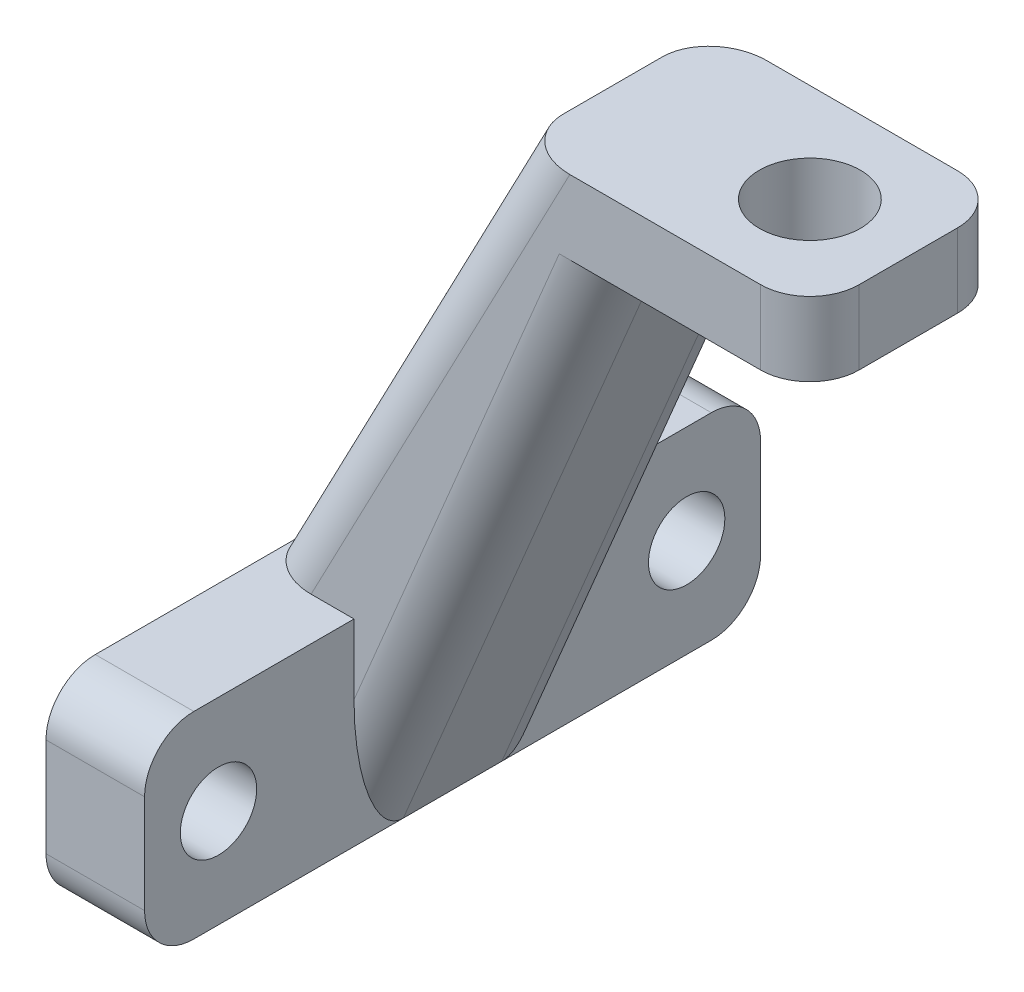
ISO-10303-21;
HEADER;
FILE_DESCRIPTION(('STEP AP214'),'2;1');
FILE_NAME('part.step','',(''),(''),'','','');
FILE_SCHEMA(('AUTOMOTIVE_DESIGN { 1 0 10303 214 1 1 1 1 }'));
ENDSEC;
DATA;
#1=APPLICATION_CONTEXT('core data for automotive mechanical design processes');
#2=APPLICATION_PROTOCOL_DEFINITION('international standard','automotive_design',2000,#1);
#3=PRODUCT_CONTEXT('',#1,'mechanical');
#4=PRODUCT('Part','Part','',(#3));
#5=PRODUCT_RELATED_PRODUCT_CATEGORY('part','',(#4));
#6=PRODUCT_DEFINITION_FORMATION('','',#4);
#7=PRODUCT_DEFINITION_CONTEXT('part definition',#1,'design');
#8=PRODUCT_DEFINITION('design','',#6,#7);
#9=PRODUCT_DEFINITION_SHAPE('','',#8);
#10=(LENGTH_UNIT() NAMED_UNIT(*) SI_UNIT(.MILLI.,.METRE.));
#11=(NAMED_UNIT(*) PLANE_ANGLE_UNIT() SI_UNIT($,.RADIAN.));
#12=(NAMED_UNIT(*) SI_UNIT($,.STERADIAN.) SOLID_ANGLE_UNIT());
#13=UNCERTAINTY_MEASURE_WITH_UNIT(LENGTH_MEASURE(1.E-05),#10,'distance_accuracy_value','');
#14=(GEOMETRIC_REPRESENTATION_CONTEXT(3) GLOBAL_UNCERTAINTY_ASSIGNED_CONTEXT((#13)) GLOBAL_UNIT_ASSIGNED_CONTEXT((#10,
#11,#12)) REPRESENTATION_CONTEXT('',''));
#15=CARTESIAN_POINT('',(0.,0.,0.));
#16=DIRECTION('',(0.,0.,1.));
#17=DIRECTION('',(1.,0.,0.));
#18=AXIS2_PLACEMENT_3D('',#15,#16,#17);
#19=CARTESIAN_POINT('',(-18.5,0.,0.));
#20=DIRECTION('',(1.,0.,0.));
#21=DIRECTION('',(0.,0.,-1.));
#22=AXIS2_PLACEMENT_3D('',#19,#20,#21);
#23=PLANE('',#22);
#24=CARTESIAN_POINT('',(-18.5,-21.,9.5));
#25=DIRECTION('',(1.,0.,0.));
#26=DIRECTION('',(0.,0.,-1.));
#27=AXIS2_PLACEMENT_3D('',#24,#25,#26);
#28=CIRCLE('',#27,1.55);
#29=CARTESIAN_POINT('',(-18.5,-21.,7.95));
#30=VERTEX_POINT('',#29);
#31=EDGE_CURVE('E391',#30,#30,#28,.T.);
#32=ORIENTED_EDGE('',*,*,#31,.T.);
#33=EDGE_LOOP('',(#32));
#34=FACE_BOUND('',#33,.T.);
#35=DIRECTION('',(0.,0.,-1.));
#36=VECTOR('',#35,1.);
#37=CARTESIAN_POINT('',(-18.5,-17.,-12.5));
#38=LINE('',#37,#36);
#39=CARTESIAN_POINT('',(-18.5,-17.,-2.));
#40=VERTEX_POINT('',#39);
#41=CARTESIAN_POINT('',(-18.5,-17.,-10.5));
#42=VERTEX_POINT('',#41);
#43=EDGE_CURVE('E395',#40,#42,#38,.T.);
#44=ORIENTED_EDGE('',*,*,#43,.T.);
#45=CARTESIAN_POINT('',(-18.5,-19.,-10.5));
#46=DIRECTION('',(1.,0.,0.));
#47=DIRECTION('',(0.,0.,-1.));
#48=AXIS2_PLACEMENT_3D('',#45,#46,#47);
#49=CIRCLE('',#48,2.);
#50=CARTESIAN_POINT('',(-18.5,-19.,-12.5));
#51=VERTEX_POINT('',#50);
#52=EDGE_CURVE('E587',#42,#51,#49,.F.);
#53=ORIENTED_EDGE('',*,*,#52,.T.);
#54=DIRECTION('',(0.,-1.,0.));
#55=VECTOR('',#54,1.);
#56=CARTESIAN_POINT('',(-18.5,-25.,-12.5));
#57=LINE('',#56,#55);
#58=CARTESIAN_POINT('',(-18.5,-23.,-12.5));
#59=VERTEX_POINT('',#58);
#60=EDGE_CURVE('E552',#51,#59,#57,.T.);
#61=ORIENTED_EDGE('',*,*,#60,.T.);
#62=CARTESIAN_POINT('',(-18.5,-23.,-10.5));
#63=DIRECTION('',(1.,0.,0.));
#64=DIRECTION('',(0.,0.,-1.));
#65=AXIS2_PLACEMENT_3D('',#62,#63,#64);
#66=CIRCLE('',#65,2.);
#67=CARTESIAN_POINT('',(-18.5,-25.,-10.5));
#68=VERTEX_POINT('',#67);
#69=EDGE_CURVE('E584',#59,#68,#66,.F.);
#70=ORIENTED_EDGE('',*,*,#69,.T.);
#71=DIRECTION('',(0.,0.,1.));
#72=VECTOR('',#71,1.);
#73=CARTESIAN_POINT('',(-18.5,-25.,-12.5));
#74=LINE('',#73,#72);
#75=CARTESIAN_POINT('',(-18.5,-25.,10.5));
#76=VERTEX_POINT('',#75);
#77=EDGE_CURVE('E422',#68,#76,#74,.T.);
#78=ORIENTED_EDGE('',*,*,#77,.T.);
#79=CARTESIAN_POINT('',(-18.5,-23.,10.5));
#80=DIRECTION('',(1.,0.,0.));
#81=DIRECTION('',(0.,0.,-1.));
#82=AXIS2_PLACEMENT_3D('',#79,#80,#81);
#83=CIRCLE('',#82,2.);
#84=CARTESIAN_POINT('',(-18.5,-23.,12.5));
#85=VERTEX_POINT('',#84);
#86=EDGE_CURVE('E510',#76,#85,#83,.F.);
#87=ORIENTED_EDGE('',*,*,#86,.T.);
#88=DIRECTION('',(0.,1.,0.));
#89=VECTOR('',#88,1.);
#90=CARTESIAN_POINT('',(-18.5,-25.,12.5));
#91=LINE('',#90,#89);
#92=CARTESIAN_POINT('',(-18.5,-19.,12.5));
#93=VERTEX_POINT('',#92);
#94=EDGE_CURVE('E254',#85,#93,#91,.T.);
#95=ORIENTED_EDGE('',*,*,#94,.T.);
#96=CARTESIAN_POINT('',(-18.5,-19.,10.5));
#97=DIRECTION('',(1.,0.,0.));
#98=DIRECTION('',(0.,0.,-1.));
#99=AXIS2_PLACEMENT_3D('',#96,#97,#98);
#100=CIRCLE('',#99,2.);
#101=CARTESIAN_POINT('',(-18.5,-17.,10.5));
#102=VERTEX_POINT('',#101);
#103=EDGE_CURVE('E575',#93,#102,#100,.F.);
#104=ORIENTED_EDGE('',*,*,#103,.T.);
#105=DIRECTION('',(0.,0.,1.));
#106=VECTOR('',#105,1.);
#107=CARTESIAN_POINT('',(-18.5,-17.,-28.7032386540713));
#108=LINE('',#107,#106);
#109=CARTESIAN_POINT('',(-18.5,-17.,2.));
#110=VERTEX_POINT('',#109);
#111=EDGE_CURVE('E230',#110,#102,#108,.T.);
#112=ORIENTED_EDGE('',*,*,#111,.F.);
#113=EDGE_CURVE('E235',#40,#110,#108,.T.);
#114=ORIENTED_EDGE('',*,*,#113,.F.);
#115=EDGE_LOOP('',(#44,#53,#61,#70,#78,#87,#95,#104,#112,#114));
#116=FACE_BOUND('',#115,.T.);
#117=CARTESIAN_POINT('',(-18.5,-21.,-9.50000000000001));
#118=DIRECTION('',(1.,0.,0.));
#119=DIRECTION('',(0.,0.,-1.));
#120=AXIS2_PLACEMENT_3D('',#117,#118,#119);
#121=CIRCLE('',#120,1.55);
#122=CARTESIAN_POINT('',(-18.5,-21.,-11.05));
#123=VERTEX_POINT('',#122);
#124=EDGE_CURVE('E231',#123,#123,#121,.F.);
#125=ORIENTED_EDGE('',*,*,#124,.F.);
#126=EDGE_LOOP('',(#125));
#127=FACE_BOUND('',#126,.T.);
#128=ADVANCED_FACE('F47',(#34,#116,#127),#23,.F.);
#129=CARTESIAN_POINT('',(-14.5,-17.,-12.5));
#130=DIRECTION('',(0.,1.,0.));
#131=DIRECTION('',(0.,0.,1.));
#132=AXIS2_PLACEMENT_3D('',#129,#130,#131);
#133=PLANE('',#132);
#134=DIRECTION('',(0.,0.,-1.));
#135=VECTOR('',#134,1.);
#136=CARTESIAN_POINT('',(-14.5,-17.,-12.5));
#137=LINE('',#136,#135);
#138=CARTESIAN_POINT('',(-14.5,-17.,-4.));
#139=VERTEX_POINT('',#138);
#140=CARTESIAN_POINT('',(-14.5,-17.,-10.5));
#141=VERTEX_POINT('',#140);
#142=EDGE_CURVE('E208',#139,#141,#137,.T.);
#143=ORIENTED_EDGE('',*,*,#142,.T.);
#144=DIRECTION('',(-1.,0.,0.));
#145=VECTOR('',#144,1.);
#146=CARTESIAN_POINT('',(-14.5,-17.,-10.5));
#147=LINE('',#146,#145);
#148=EDGE_CURVE('E528',#141,#42,#147,.T.);
#149=ORIENTED_EDGE('',*,*,#148,.T.);
#150=ORIENTED_EDGE('',*,*,#43,.F.);
#151=CARTESIAN_POINT('',(-16.2411286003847,-17.,-2.));
#152=DIRECTION('',(0.,1.,0.));
#153=DIRECTION('',(-1.,0.,0.));
#154=AXIS2_PLACEMENT_3D('',#151,#152,#153);
#155=ELLIPSE('',#154,2.2588713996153,2.);
#156=CARTESIAN_POINT('',(-16.2411286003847,-17.,-4.));
#157=VERTEX_POINT('',#156);
#158=EDGE_CURVE('E440',#40,#157,#155,.F.);
#159=ORIENTED_EDGE('',*,*,#158,.T.);
#160=DIRECTION('',(-1.,0.,0.));
#161=VECTOR('',#160,1.);
#162=CARTESIAN_POINT('',(-18.5,-17.,-4.));
#163=LINE('',#162,#161);
#164=EDGE_CURVE('E250',#139,#157,#163,.T.);
#165=ORIENTED_EDGE('',*,*,#164,.F.);
#166=EDGE_LOOP('',(#143,#149,#150,#159,#165));
#167=FACE_BOUND('',#166,.T.);
#168=ADVANCED_FACE('F331',(#167),#133,.T.);
#169=CARTESIAN_POINT('',(0.,3.,0.));
#170=DIRECTION('',(0.,-1.,0.));
#171=DIRECTION('',(0.,0.,-1.));
#172=AXIS2_PLACEMENT_3D('',#169,#170,#171);
#173=PLANE('',#172);
#174=DIRECTION('',(0.,0.,-1.));
#175=VECTOR('',#174,1.);
#176=CARTESIAN_POINT('',(4.,3.,4.));
#177=LINE('',#176,#175);
#178=CARTESIAN_POINT('',(4.,3.,2.));
#179=VERTEX_POINT('',#178);
#180=CARTESIAN_POINT('',(4.,3.,-2.));
#181=VERTEX_POINT('',#180);
#182=EDGE_CURVE('E278',#179,#181,#177,.T.);
#183=ORIENTED_EDGE('',*,*,#182,.T.);
#184=CARTESIAN_POINT('',(2.,3.,-2.));
#185=DIRECTION('',(0.,-1.,0.));
#186=DIRECTION('',(0.,0.,-1.));
#187=AXIS2_PLACEMENT_3D('',#184,#185,#186);
#188=CIRCLE('',#187,2.);
#189=CARTESIAN_POINT('',(2.,3.,-4.));
#190=VERTEX_POINT('',#189);
#191=EDGE_CURVE('E242',#181,#190,#188,.F.);
#192=ORIENTED_EDGE('',*,*,#191,.T.);
#193=DIRECTION('',(-1.,0.,0.));
#194=VECTOR('',#193,1.);
#195=CARTESIAN_POINT('',(-4.,3.,-4.));
#196=LINE('',#195,#194);
#197=CARTESIAN_POINT('',(-5.7411286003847,3.,-4.));
#198=VERTEX_POINT('',#197);
#199=EDGE_CURVE('E273',#190,#198,#196,.T.);
#200=ORIENTED_EDGE('',*,*,#199,.T.);
#201=CARTESIAN_POINT('',(-5.7411286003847,3.,-2.));
#202=DIRECTION('',(0.,-1.,0.));
#203=DIRECTION('',(-1.,0.,0.));
#204=AXIS2_PLACEMENT_3D('',#201,#202,#203);
#205=ELLIPSE('',#204,2.2588713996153,2.);
#206=CARTESIAN_POINT('',(-8.00000000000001,3.,-2.));
#207=VERTEX_POINT('',#206);
#208=EDGE_CURVE('E612',#198,#207,#205,.F.);
#209=ORIENTED_EDGE('',*,*,#208,.T.);
#210=DIRECTION('',(0.,0.,1.));
#211=VECTOR('',#210,1.);
#212=CARTESIAN_POINT('',(-8.00000000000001,3.,-28.7032386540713));
#213=LINE('',#212,#211);
#214=CARTESIAN_POINT('',(-8.00000000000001,3.,2.));
#215=VERTEX_POINT('',#214);
#216=EDGE_CURVE('E255',#207,#215,#213,.T.);
#217=ORIENTED_EDGE('',*,*,#216,.T.);
#218=CARTESIAN_POINT('',(-5.7411286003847,3.,2.));
#219=DIRECTION('',(0.,-1.,0.));
#220=DIRECTION('',(1.,0.,0.));
#221=AXIS2_PLACEMENT_3D('',#218,#219,#220);
#222=ELLIPSE('',#221,2.2588713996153,2.);
#223=CARTESIAN_POINT('',(-5.74112860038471,3.,4.));
#224=VERTEX_POINT('',#223);
#225=EDGE_CURVE('E569',#215,#224,#222,.F.);
#226=ORIENTED_EDGE('',*,*,#225,.T.);
#227=DIRECTION('',(1.,0.,0.));
#228=VECTOR('',#227,1.);
#229=CARTESIAN_POINT('',(-4.,3.,4.));
#230=LINE('',#229,#228);
#231=CARTESIAN_POINT('',(2.,3.,4.));
#232=VERTEX_POINT('',#231);
#233=EDGE_CURVE('E277',#224,#232,#230,.T.);
#234=ORIENTED_EDGE('',*,*,#233,.T.);
#235=CARTESIAN_POINT('',(2.,3.,2.));
#236=DIRECTION('',(0.,-1.,0.));
#237=DIRECTION('',(0.,0.,-1.));
#238=AXIS2_PLACEMENT_3D('',#235,#236,#237);
#239=CIRCLE('',#238,2.);
#240=EDGE_CURVE('E607',#232,#179,#239,.F.);
#241=ORIENTED_EDGE('',*,*,#240,.T.);
#242=EDGE_LOOP('',(#183,#192,#200,#209,#217,#226,#234,#241));
#243=FACE_BOUND('',#242,.T.);
#244=CARTESIAN_POINT('',(0.,3.,0.));
#245=DIRECTION('',(0.,1.,0.));
#246=DIRECTION('',(0.,0.,1.));
#247=AXIS2_PLACEMENT_3D('',#244,#245,#246);
#248=CIRCLE('',#247,2.05);
#249=CARTESIAN_POINT('',(0.,3.,2.05));
#250=VERTEX_POINT('',#249);
#251=EDGE_CURVE('E650',#250,#250,#248,.T.);
#252=ORIENTED_EDGE('',*,*,#251,.F.);
#253=EDGE_LOOP('',(#252));
#254=FACE_BOUND('',#253,.T.);
#255=ADVANCED_FACE('F327',(#243,#254),#173,.F.);
#256=CARTESIAN_POINT('',(0.,0.,0.));
#257=DIRECTION('',(0.,-1.,0.));
#258=DIRECTION('',(0.,0.,-1.));
#259=AXIS2_PLACEMENT_3D('',#256,#257,#258);
#260=PLANE('',#259);
#261=DIRECTION('',(-1.,0.,0.));
#262=VECTOR('',#261,1.);
#263=CARTESIAN_POINT('',(-4.,0.,-4.));
#264=LINE('',#263,#262);
#265=CARTESIAN_POINT('',(2.,0.,-4.));
#266=VERTEX_POINT('',#265);
#267=CARTESIAN_POINT('',(-6.169239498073,0.,-4.));
#268=VERTEX_POINT('',#267);
#269=EDGE_CURVE('E258',#266,#268,#264,.T.);
#270=ORIENTED_EDGE('',*,*,#269,.F.);
#271=CARTESIAN_POINT('',(2.,0.,-2.));
#272=DIRECTION('',(0.,-1.,0.));
#273=DIRECTION('',(0.,0.,-1.));
#274=AXIS2_PLACEMENT_3D('',#271,#272,#273);
#275=CIRCLE('',#274,2.);
#276=CARTESIAN_POINT('',(4.,0.,-2.));
#277=VERTEX_POINT('',#276);
#278=EDGE_CURVE('E630',#266,#277,#275,.T.);
#279=ORIENTED_EDGE('',*,*,#278,.T.);
#280=DIRECTION('',(0.,0.,-1.));
#281=VECTOR('',#280,1.);
#282=CARTESIAN_POINT('',(4.,0.,4.));
#283=LINE('',#282,#281);
#284=CARTESIAN_POINT('',(4.,0.,2.));
#285=VERTEX_POINT('',#284);
#286=EDGE_CURVE('E263',#285,#277,#283,.T.);
#287=ORIENTED_EDGE('',*,*,#286,.F.);
#288=CARTESIAN_POINT('',(2.,0.,2.));
#289=DIRECTION('',(0.,-1.,0.));
#290=DIRECTION('',(0.,0.,-1.));
#291=AXIS2_PLACEMENT_3D('',#288,#289,#290);
#292=CIRCLE('',#291,2.);
#293=CARTESIAN_POINT('',(2.,0.,4.));
#294=VERTEX_POINT('',#293);
#295=EDGE_CURVE('E290',#285,#294,#292,.T.);
#296=ORIENTED_EDGE('',*,*,#295,.T.);
#297=DIRECTION('',(1.,0.,0.));
#298=VECTOR('',#297,1.);
#299=CARTESIAN_POINT('',(-4.,0.,4.));
#300=LINE('',#299,#298);
#301=CARTESIAN_POINT('',(-6.169239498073,0.,4.));
#302=VERTEX_POINT('',#301);
#303=EDGE_CURVE('E636',#302,#294,#300,.T.);
#304=ORIENTED_EDGE('',*,*,#303,.F.);
#305=CARTESIAN_POINT('',(-6.169239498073,0.,2.));
#306=DIRECTION('',(0.,-1.,0.));
#307=DIRECTION('',(-1.,0.,0.));
#308=AXIS2_PLACEMENT_3D('',#305,#306,#307);
#309=ELLIPSE('',#308,2.169239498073,2.);
#310=CARTESIAN_POINT('',(-4.,0.,2.));
#311=VERTEX_POINT('',#310);
#312=EDGE_CURVE('E446',#302,#311,#309,.F.);
#313=ORIENTED_EDGE('',*,*,#312,.T.);
#314=CARTESIAN_POINT('',(-4.,0.,-2.));
#315=DIRECTION('',(0.,0.,1.));
#316=VECTOR('',#315,1.);
#317=LINE('',#314,#316);
#318=CARTESIAN_POINT('',(-4.,0.,-2.));
#319=VERTEX_POINT('',#318);
#320=EDGE_CURVE('E262',#319,#311,#317,.T.);
#321=ORIENTED_EDGE('',*,*,#320,.F.);
#322=CARTESIAN_POINT('',(-6.169239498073,0.,-2.));
#323=DIRECTION('',(0.,-1.,0.));
#324=DIRECTION('',(-1.,0.,0.));
#325=AXIS2_PLACEMENT_3D('',#322,#323,#324);
#326=ELLIPSE('',#325,2.169239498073,2.);
#327=EDGE_CURVE('E58',#319,#268,#326,.F.);
#328=ORIENTED_EDGE('',*,*,#327,.T.);
#329=EDGE_LOOP('',(#270,#279,#287,#296,#304,#313,#321,#328));
#330=FACE_BOUND('',#329,.T.);
#331=CARTESIAN_POINT('',(0.,0.,0.));
#332=DIRECTION('',(0.,1.,0.));
#333=DIRECTION('',(0.,0.,1.));
#334=AXIS2_PLACEMENT_3D('',#331,#332,#333);
#335=CIRCLE('',#334,2.05);
#336=CARTESIAN_POINT('',(0.,0.,2.05));
#337=VERTEX_POINT('',#336);
#338=EDGE_CURVE('E647',#337,#337,#335,.T.);
#339=ORIENTED_EDGE('',*,*,#338,.T.);
#340=EDGE_LOOP('',(#339));
#341=FACE_BOUND('',#340,.T.);
#342=ADVANCED_FACE('F330',(#330,#341),#260,.T.);
#343=CARTESIAN_POINT('',(4.,3.,4.));
#344=DIRECTION('',(-1.,0.,0.));
#345=DIRECTION('',(0.,0.,1.));
#346=AXIS2_PLACEMENT_3D('',#343,#344,#345);
#347=PLANE('',#346);
#348=ORIENTED_EDGE('',*,*,#286,.T.);
#349=DIRECTION('',(0.,-1.,0.));
#350=VECTOR('',#349,1.);
#351=CARTESIAN_POINT('',(4.,3.,-2.));
#352=LINE('',#351,#350);
#353=EDGE_CURVE('E621',#277,#181,#352,.F.);
#354=ORIENTED_EDGE('',*,*,#353,.T.);
#355=ORIENTED_EDGE('',*,*,#182,.F.);
#356=DIRECTION('',(0.,-1.,0.));
#357=VECTOR('',#356,1.);
#358=CARTESIAN_POINT('',(4.,3.,2.));
#359=LINE('',#358,#357);
#360=EDGE_CURVE('E626',#179,#285,#359,.T.);
#361=ORIENTED_EDGE('',*,*,#360,.T.);
#362=EDGE_LOOP('',(#348,#354,#355,#361));
#363=FACE_BOUND('',#362,.T.);
#364=ADVANCED_FACE('F336',(#363),#347,.F.);
#365=CARTESIAN_POINT('',(-4.,3.,-4.));
#366=DIRECTION('',(0.,0.,1.));
#367=DIRECTION('',(1.,0.,0.));
#368=AXIS2_PLACEMENT_3D('',#365,#366,#367);
#369=PLANE('',#368);
#370=ORIENTED_EDGE('',*,*,#199,.F.);
#371=DIRECTION('',(0.,-1.,0.));
#372=VECTOR('',#371,1.);
#373=CARTESIAN_POINT('',(2.,3.,-4.));
#374=LINE('',#373,#372);
#375=EDGE_CURVE('E286',#190,#266,#374,.T.);
#376=ORIENTED_EDGE('',*,*,#375,.T.);
#377=ORIENTED_EDGE('',*,*,#269,.T.);
#378=DIRECTION('',(0.387232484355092,0.921982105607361,0.));
#379=VECTOR('',#378,1.);
#380=CARTESIAN_POINT('',(-16.3439642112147,-24.2255350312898,-4.));
#381=LINE('',#380,#379);
#382=CARTESIAN_POINT('',(-14.5,-19.8351440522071,-4.));
#383=VERTEX_POINT('',#382);
#384=EDGE_CURVE('E279',#268,#383,#381,.F.);
#385=ORIENTED_EDGE('',*,*,#384,.T.);
#386=DIRECTION('',(0.,1.,0.));
#387=VECTOR('',#386,1.);
#388=CARTESIAN_POINT('',(-14.5,-25.,-4.));
#389=LINE('',#388,#387);
#390=EDGE_CURVE('E220',#383,#139,#389,.T.);
#391=ORIENTED_EDGE('',*,*,#390,.T.);
#392=ORIENTED_EDGE('',*,*,#164,.T.);
#393=DIRECTION('',(0.46483389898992,0.885397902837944,0.));
#394=VECTOR('',#393,1.);
#395=CARTESIAN_POINT('',(-6.22920419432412,2.07033220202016,-4.));
#396=LINE('',#395,#394);
#397=EDGE_CURVE('E282',#157,#198,#396,.T.);
#398=ORIENTED_EDGE('',*,*,#397,.T.);
#399=EDGE_LOOP('',(#370,#376,#377,#385,#391,#392,#398));
#400=FACE_BOUND('',#399,.T.);
#401=ADVANCED_FACE('F713',(#400),#369,.F.);
#402=CARTESIAN_POINT('',(-4.,3.,4.));
#403=DIRECTION('',(0.,0.,-1.));
#404=DIRECTION('',(-1.,0.,0.));
#405=AXIS2_PLACEMENT_3D('',#402,#403,#404);
#406=PLANE('',#405);
#407=ORIENTED_EDGE('',*,*,#303,.T.);
#408=DIRECTION('',(0.,-1.,0.));
#409=VECTOR('',#408,1.);
#410=CARTESIAN_POINT('',(2.,3.,4.));
#411=LINE('',#410,#409);
#412=EDGE_CURVE('E571',#294,#232,#411,.F.);
#413=ORIENTED_EDGE('',*,*,#412,.T.);
#414=ORIENTED_EDGE('',*,*,#233,.F.);
#415=DIRECTION('',(-0.46483389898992,-0.885397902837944,0.));
#416=VECTOR('',#415,1.);
#417=CARTESIAN_POINT('',(-16.7292041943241,-17.9296677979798,4.));
#418=LINE('',#417,#416);
#419=CARTESIAN_POINT('',(-16.2411286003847,-17.,4.));
#420=VERTEX_POINT('',#419);
#421=EDGE_CURVE('E228',#224,#420,#418,.T.);
#422=ORIENTED_EDGE('',*,*,#421,.T.);
#423=DIRECTION('',(1.,0.,0.));
#424=VECTOR('',#423,1.);
#425=CARTESIAN_POINT('',(-18.5,-17.,4.));
#426=LINE('',#425,#424);
#427=CARTESIAN_POINT('',(-14.5,-17.,4.));
#428=VERTEX_POINT('',#427);
#429=EDGE_CURVE('E203',#420,#428,#426,.T.);
#430=ORIENTED_EDGE('',*,*,#429,.T.);
#431=DIRECTION('',(0.,1.,0.));
#432=VECTOR('',#431,1.);
#433=CARTESIAN_POINT('',(-14.5,-25.,4.));
#434=LINE('',#433,#432);
#435=CARTESIAN_POINT('',(-14.5,-19.8351440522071,4.));
#436=VERTEX_POINT('',#435);
#437=EDGE_CURVE('E211',#436,#428,#434,.T.);
#438=ORIENTED_EDGE('',*,*,#437,.F.);
#439=DIRECTION('',(0.387232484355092,0.921982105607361,0.));
#440=VECTOR('',#439,1.);
#441=CARTESIAN_POINT('',(-5.84396421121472,0.774464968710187,4.));
#442=LINE('',#441,#440);
#443=EDGE_CURVE('E603',#436,#302,#442,.T.);
#444=ORIENTED_EDGE('',*,*,#443,.T.);
#445=EDGE_LOOP('',(#407,#413,#414,#422,#430,#438,#444));
#446=FACE_BOUND('',#445,.T.);
#447=ADVANCED_FACE('F225',(#446),#406,.F.);
#448=CARTESIAN_POINT('',(0.,3.,0.));
#449=DIRECTION('',(0.,-1.,0.));
#450=DIRECTION('',(0.,0.,-1.));
#451=AXIS2_PLACEMENT_3D('',#448,#449,#450);
#452=CYLINDRICAL_SURFACE('',#451,2.05);
#453=ORIENTED_EDGE('',*,*,#251,.T.);
#454=EDGE_LOOP('',(#453));
#455=FACE_BOUND('',#454,.T.);
#456=ORIENTED_EDGE('',*,*,#338,.F.);
#457=EDGE_LOOP('',(#456));
#458=FACE_BOUND('',#457,.T.);
#459=ADVANCED_FACE('F320',(#455,#458),#452,.F.);
#460=CARTESIAN_POINT('',(-3.40020401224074,1.42808568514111,0.));
#461=DIRECTION('',(0.921982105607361,-0.387232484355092,0.));
#462=DIRECTION('',(0.387232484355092,0.921982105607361,0.));
#463=AXIS2_PLACEMENT_3D('',#460,#461,#462);
#464=PLANE('',#463);
#465=ORIENTED_EDGE('',*,*,#320,.T.);
#466=DIRECTION('',(0.387232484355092,0.921982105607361,0.));
#467=VECTOR('',#466,1.);
#468=CARTESIAN_POINT('',(-14.5,-25.,2.));
#469=LINE('',#468,#467);
#470=CARTESIAN_POINT('',(-14.5,-25.,2.));
#471=VERTEX_POINT('',#470);
#472=EDGE_CURVE('E538',#311,#471,#469,.F.);
#473=ORIENTED_EDGE('',*,*,#472,.T.);
#474=DIRECTION('',(0.,0.,-1.));
#475=VECTOR('',#474,1.);
#476=CARTESIAN_POINT('',(-14.5,-25.,4.));
#477=LINE('',#476,#475);
#478=CARTESIAN_POINT('',(-14.5,-25.,-2.));
#479=VERTEX_POINT('',#478);
#480=EDGE_CURVE('E51',#471,#479,#477,.T.);
#481=ORIENTED_EDGE('',*,*,#480,.T.);
#482=DIRECTION('',(0.387232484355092,0.921982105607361,0.));
#483=VECTOR('',#482,1.);
#484=CARTESIAN_POINT('',(-4.,0.,-2.));
#485=LINE('',#484,#483);
#486=EDGE_CURVE('E590',#479,#319,#485,.T.);
#487=ORIENTED_EDGE('',*,*,#486,.T.);
#488=EDGE_LOOP('',(#465,#473,#481,#487));
#489=FACE_BOUND('',#488,.T.);
#490=ADVANCED_FACE('F310',(#489),#464,.T.);
#491=CARTESIAN_POINT('',(-14.5,0.,0.));
#492=DIRECTION('',(1.,0.,0.));
#493=DIRECTION('',(0.,0.,-1.));
#494=AXIS2_PLACEMENT_3D('',#491,#492,#493);
#495=PLANE('',#494);
#496=CARTESIAN_POINT('',(-14.5,-21.,9.5));
#497=DIRECTION('',(1.,0.,0.));
#498=DIRECTION('',(0.,0.,-1.));
#499=AXIS2_PLACEMENT_3D('',#496,#497,#498);
#500=CIRCLE('',#499,1.55);
#501=CARTESIAN_POINT('',(-14.5,-21.,7.95));
#502=VERTEX_POINT('',#501);
#503=EDGE_CURVE('E409',#502,#502,#500,.T.);
#504=ORIENTED_EDGE('',*,*,#503,.F.);
#505=EDGE_LOOP('',(#504));
#506=FACE_BOUND('',#505,.T.);
#507=DIRECTION('',(0.,1.,0.));
#508=VECTOR('',#507,1.);
#509=CARTESIAN_POINT('',(-14.5,-25.,12.5));
#510=LINE('',#509,#508);
#511=CARTESIAN_POINT('',(-14.5,-23.,12.5));
#512=VERTEX_POINT('',#511);
#513=CARTESIAN_POINT('',(-14.5,-19.,12.5));
#514=VERTEX_POINT('',#513);
#515=EDGE_CURVE('E418',#512,#514,#510,.T.);
#516=ORIENTED_EDGE('',*,*,#515,.F.);
#517=CARTESIAN_POINT('',(-14.5,-23.,10.5));
#518=DIRECTION('',(1.,0.,0.));
#519=DIRECTION('',(0.,0.,-1.));
#520=AXIS2_PLACEMENT_3D('',#517,#518,#519);
#521=CIRCLE('',#520,2.);
#522=CARTESIAN_POINT('',(-14.5,-25.,10.5));
#523=VERTEX_POINT('',#522);
#524=EDGE_CURVE('E435',#512,#523,#521,.T.);
#525=ORIENTED_EDGE('',*,*,#524,.T.);
#526=DIRECTION('',(0.,0.,1.));
#527=VECTOR('',#526,1.);
#528=CARTESIAN_POINT('',(-14.5,-25.,-12.5));
#529=LINE('',#528,#527);
#530=CARTESIAN_POINT('',(-14.5,-25.,4.));
#531=VERTEX_POINT('',#530);
#532=EDGE_CURVE('E541',#531,#523,#529,.T.);
#533=ORIENTED_EDGE('',*,*,#532,.F.);
#534=CARTESIAN_POINT('',(-14.5,-25.,4.));
#535=DIRECTION('',(0.,0.,-1.));
#536=VECTOR('',#535,1.);
#537=LINE('',#534,#536);
#538=EDGE_CURVE('E354',#531,#471,#537,.T.);
#539=ORIENTED_EDGE('',*,*,#538,.T.);
#540=CARTESIAN_POINT('',(-14.5,-19.8351440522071,2.));
#541=DIRECTION('',(1.,0.,0.));
#542=DIRECTION('',(0.,-1.,0.));
#543=AXIS2_PLACEMENT_3D('',#540,#541,#542);
#544=ELLIPSE('',#543,5.16485594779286,2.);
#545=EDGE_CURVE('E215',#471,#436,#544,.F.);
#546=ORIENTED_EDGE('',*,*,#545,.T.);
#547=ORIENTED_EDGE('',*,*,#437,.T.);
#548=CARTESIAN_POINT('',(-14.5,-17.,10.5));
#549=VERTEX_POINT('',#548);
#550=EDGE_CURVE('E199',#549,#428,#137,.T.);
#551=ORIENTED_EDGE('',*,*,#550,.F.);
#552=CARTESIAN_POINT('',(-14.5,-19.,10.5));
#553=DIRECTION('',(1.,0.,0.));
#554=DIRECTION('',(0.,0.,-1.));
#555=AXIS2_PLACEMENT_3D('',#552,#553,#554);
#556=CIRCLE('',#555,2.);
#557=EDGE_CURVE('E432',#549,#514,#556,.T.);
#558=ORIENTED_EDGE('',*,*,#557,.T.);
#559=EDGE_LOOP('',(#516,#525,#533,#539,#546,#547,#551,#558));
#560=FACE_BOUND('',#559,.T.);
#561=ADVANCED_FACE('F213',(#506,#560),#495,.T.);
#562=CARTESIAN_POINT('',(-14.5,-25.,12.5));
#563=DIRECTION('',(0.,0.,1.));
#564=DIRECTION('',(1.,0.,0.));
#565=AXIS2_PLACEMENT_3D('',#562,#563,#564);
#566=PLANE('',#565);
#567=ORIENTED_EDGE('',*,*,#94,.F.);
#568=DIRECTION('',(-1.,0.,0.));
#569=VECTOR('',#568,1.);
#570=CARTESIAN_POINT('',(-14.5,-23.,12.5));
#571=LINE('',#570,#569);
#572=EDGE_CURVE('E430',#85,#512,#571,.F.);
#573=ORIENTED_EDGE('',*,*,#572,.T.);
#574=ORIENTED_EDGE('',*,*,#515,.T.);
#575=DIRECTION('',(-1.,0.,0.));
#576=VECTOR('',#575,1.);
#577=CARTESIAN_POINT('',(-14.5,-19.,12.5));
#578=LINE('',#577,#576);
#579=EDGE_CURVE('E502',#514,#93,#578,.T.);
#580=ORIENTED_EDGE('',*,*,#579,.T.);
#581=EDGE_LOOP('',(#567,#573,#574,#580));
#582=FACE_BOUND('',#581,.T.);
#583=ADVANCED_FACE('F321',(#582),#566,.T.);
#584=CARTESIAN_POINT('',(-14.5,-25.,-12.5));
#585=DIRECTION('',(0.,-1.,0.));
#586=DIRECTION('',(0.,0.,-1.));
#587=AXIS2_PLACEMENT_3D('',#584,#585,#586);
#588=PLANE('',#587);
#589=ORIENTED_EDGE('',*,*,#77,.F.);
#590=DIRECTION('',(-1.,0.,0.));
#591=VECTOR('',#590,1.);
#592=CARTESIAN_POINT('',(-14.5,-25.,-10.5));
#593=LINE('',#592,#591);
#594=CARTESIAN_POINT('',(-14.5,-25.,-10.5));
#595=VERTEX_POINT('',#594);
#596=EDGE_CURVE('E532',#68,#595,#593,.F.);
#597=ORIENTED_EDGE('',*,*,#596,.T.);
#598=CARTESIAN_POINT('',(-14.5,-25.,-4.));
#599=VERTEX_POINT('',#598);
#600=EDGE_CURVE('E221',#595,#599,#529,.T.);
#601=ORIENTED_EDGE('',*,*,#600,.T.);
#602=CARTESIAN_POINT('',(-14.5,-25.,-2.));
#603=DIRECTION('',(0.,0.,-1.));
#604=VECTOR('',#603,1.);
#605=LINE('',#602,#604);
#606=EDGE_CURVE('E65',#479,#599,#605,.T.);
#607=ORIENTED_EDGE('',*,*,#606,.F.);
#608=ORIENTED_EDGE('',*,*,#480,.F.);
#609=ORIENTED_EDGE('',*,*,#538,.F.);
#610=ORIENTED_EDGE('',*,*,#532,.T.);
#611=DIRECTION('',(-1.,0.,0.));
#612=VECTOR('',#611,1.);
#613=CARTESIAN_POINT('',(-14.5,-25.,10.5));
#614=LINE('',#613,#612);
#615=EDGE_CURVE('E535',#523,#76,#614,.T.);
#616=ORIENTED_EDGE('',*,*,#615,.T.);
#617=EDGE_LOOP('',(#589,#597,#601,#607,#608,#609,#610,#616));
#618=FACE_BOUND('',#617,.T.);
#619=ADVANCED_FACE('F361',(#618),#588,.T.);
#620=CARTESIAN_POINT('',(-14.5,-25.,-12.5));
#621=DIRECTION('',(0.,0.,-1.));
#622=DIRECTION('',(-1.,0.,0.));
#623=AXIS2_PLACEMENT_3D('',#620,#621,#622);
#624=PLANE('',#623);
#625=ORIENTED_EDGE('',*,*,#60,.F.);
#626=DIRECTION('',(-1.,0.,0.));
#627=VECTOR('',#626,1.);
#628=CARTESIAN_POINT('',(-14.5,-19.,-12.5));
#629=LINE('',#628,#627);
#630=CARTESIAN_POINT('',(-14.5,-19.,-12.5));
#631=VERTEX_POINT('',#630);
#632=EDGE_CURVE('E521',#51,#631,#629,.F.);
#633=ORIENTED_EDGE('',*,*,#632,.T.);
#634=DIRECTION('',(0.,-1.,0.));
#635=VECTOR('',#634,1.);
#636=CARTESIAN_POINT('',(-14.5,-25.,-12.5));
#637=LINE('',#636,#635);
#638=CARTESIAN_POINT('',(-14.5,-23.,-12.5));
#639=VERTEX_POINT('',#638);
#640=EDGE_CURVE('E207',#631,#639,#637,.T.);
#641=ORIENTED_EDGE('',*,*,#640,.T.);
#642=DIRECTION('',(-1.,0.,0.));
#643=VECTOR('',#642,1.);
#644=CARTESIAN_POINT('',(-14.5,-23.,-12.5));
#645=LINE('',#644,#643);
#646=EDGE_CURVE('E524',#639,#59,#645,.T.);
#647=ORIENTED_EDGE('',*,*,#646,.T.);
#648=EDGE_LOOP('',(#625,#633,#641,#647));
#649=FACE_BOUND('',#648,.T.);
#650=ADVANCED_FACE('F371',(#649),#624,.T.);
#651=ORIENTED_EDGE('',*,*,#111,.T.);
#652=DIRECTION('',(-1.,0.,0.));
#653=VECTOR('',#652,1.);
#654=CARTESIAN_POINT('',(-14.5,-17.,10.5));
#655=LINE('',#654,#653);
#656=EDGE_CURVE('E74',#102,#549,#655,.F.);
#657=ORIENTED_EDGE('',*,*,#656,.T.);
#658=ORIENTED_EDGE('',*,*,#550,.T.);
#659=ORIENTED_EDGE('',*,*,#429,.F.);
#660=CARTESIAN_POINT('',(-16.2411286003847,-17.,2.));
#661=DIRECTION('',(0.,1.,0.));
#662=DIRECTION('',(1.,0.,0.));
#663=AXIS2_PLACEMENT_3D('',#660,#661,#662);
#664=ELLIPSE('',#663,2.2588713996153,2.);
#665=EDGE_CURVE('E443',#420,#110,#664,.F.);
#666=ORIENTED_EDGE('',*,*,#665,.T.);
#667=EDGE_LOOP('',(#651,#657,#658,#659,#666));
#668=FACE_BOUND('',#667,.T.);
#669=ADVANCED_FACE('F201',(#668),#133,.T.);
#670=CARTESIAN_POINT('',(-14.5,-21.,-9.50000000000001));
#671=DIRECTION('',(1.,0.,0.));
#672=DIRECTION('',(0.,0.,-1.));
#673=AXIS2_PLACEMENT_3D('',#670,#671,#672);
#674=CIRCLE('',#673,1.55);
#675=CARTESIAN_POINT('',(-14.5,-21.,-11.05));
#676=VERTEX_POINT('',#675);
#677=EDGE_CURVE('E238',#676,#676,#674,.F.);
#678=ORIENTED_EDGE('',*,*,#677,.T.);
#679=EDGE_LOOP('',(#678));
#680=FACE_BOUND('',#679,.T.);
#681=ORIENTED_EDGE('',*,*,#640,.F.);
#682=CARTESIAN_POINT('',(-14.5,-19.,-10.5));
#683=DIRECTION('',(1.,0.,0.));
#684=DIRECTION('',(0.,0.,-1.));
#685=AXIS2_PLACEMENT_3D('',#682,#683,#684);
#686=CIRCLE('',#685,2.);
#687=EDGE_CURVE('E514',#631,#141,#686,.T.);
#688=ORIENTED_EDGE('',*,*,#687,.T.);
#689=ORIENTED_EDGE('',*,*,#142,.F.);
#690=ORIENTED_EDGE('',*,*,#390,.F.);
#691=CARTESIAN_POINT('',(-14.5,-19.8351440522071,-2.));
#692=DIRECTION('',(1.,0.,0.));
#693=DIRECTION('',(0.,-1.,0.));
#694=AXIS2_PLACEMENT_3D('',#691,#692,#693);
#695=ELLIPSE('',#694,5.16485594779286,2.);
#696=EDGE_CURVE('E12',#383,#479,#695,.F.);
#697=ORIENTED_EDGE('',*,*,#696,.T.);
#698=ORIENTED_EDGE('',*,*,#606,.T.);
#699=ORIENTED_EDGE('',*,*,#600,.F.);
#700=CARTESIAN_POINT('',(-14.5,-23.,-10.5));
#701=DIRECTION('',(1.,0.,0.));
#702=DIRECTION('',(0.,0.,-1.));
#703=AXIS2_PLACEMENT_3D('',#700,#701,#702);
#704=CIRCLE('',#703,2.);
#705=EDGE_CURVE('E516',#595,#639,#704,.T.);
#706=ORIENTED_EDGE('',*,*,#705,.T.);
#707=EDGE_LOOP('',(#681,#688,#689,#690,#697,#698,#699,#706));
#708=FACE_BOUND('',#707,.T.);
#709=ADVANCED_FACE('F376',(#680,#708),#495,.T.);
#710=CARTESIAN_POINT('',(-8.00000000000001,3.,-28.7032386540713));
#711=DIRECTION('',(-0.885397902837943,0.46483389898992,0.));
#712=DIRECTION('',(-0.46483389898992,-0.885397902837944,0.));
#713=AXIS2_PLACEMENT_3D('',#710,#711,#712);
#714=PLANE('',#713);
#715=ORIENTED_EDGE('',*,*,#216,.F.);
#716=DIRECTION('',(0.46483389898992,0.885397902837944,0.));
#717=VECTOR('',#716,1.);
#718=CARTESIAN_POINT('',(-18.5,-17.,-2.));
#719=LINE('',#718,#717);
#720=EDGE_CURVE('E563',#207,#40,#719,.F.);
#721=ORIENTED_EDGE('',*,*,#720,.T.);
#722=ORIENTED_EDGE('',*,*,#113,.T.);
#723=DIRECTION('',(-0.46483389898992,-0.885397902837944,0.));
#724=VECTOR('',#723,1.);
#725=CARTESIAN_POINT('',(-8.00000000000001,3.,2.));
#726=LINE('',#725,#724);
#727=EDGE_CURVE('E561',#110,#215,#726,.F.);
#728=ORIENTED_EDGE('',*,*,#727,.T.);
#729=EDGE_LOOP('',(#715,#721,#722,#728));
#730=FACE_BOUND('',#729,.T.);
#731=ADVANCED_FACE('F380',(#730),#714,.T.);
#732=CARTESIAN_POINT('',(-18.5,-21.,9.5));
#733=DIRECTION('',(1.,0.,0.));
#734=DIRECTION('',(0.,0.,-1.));
#735=AXIS2_PLACEMENT_3D('',#732,#733,#734);
#736=CYLINDRICAL_SURFACE('',#735,1.55);
#737=ORIENTED_EDGE('',*,*,#31,.F.);
#738=EDGE_LOOP('',(#737));
#739=FACE_BOUND('',#738,.T.);
#740=ORIENTED_EDGE('',*,*,#503,.T.);
#741=EDGE_LOOP('',(#740));
#742=FACE_BOUND('',#741,.T.);
#743=ADVANCED_FACE('F402',(#739,#742),#736,.F.);
#744=CARTESIAN_POINT('',(-18.5,-21.,-9.50000000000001));
#745=DIRECTION('',(1.,0.,0.));
#746=DIRECTION('',(0.,0.,-1.));
#747=AXIS2_PLACEMENT_3D('',#744,#745,#746);
#748=CYLINDRICAL_SURFACE('',#747,1.55);
#749=ORIENTED_EDGE('',*,*,#124,.T.);
#750=EDGE_LOOP('',(#749));
#751=FACE_BOUND('',#750,.T.);
#752=ORIENTED_EDGE('',*,*,#677,.F.);
#753=EDGE_LOOP('',(#752));
#754=FACE_BOUND('',#753,.T.);
#755=ADVANCED_FACE('F398',(#751,#754),#748,.F.);
#756=CARTESIAN_POINT('',(2.,3.,-2.));
#757=DIRECTION('',(0.,-1.,0.));
#758=DIRECTION('',(0.,0.,-1.));
#759=AXIS2_PLACEMENT_3D('',#756,#757,#758);
#760=CYLINDRICAL_SURFACE('',#759,2.);
#761=ORIENTED_EDGE('',*,*,#191,.F.);
#762=ORIENTED_EDGE('',*,*,#353,.F.);
#763=ORIENTED_EDGE('',*,*,#278,.F.);
#764=ORIENTED_EDGE('',*,*,#375,.F.);
#765=EDGE_LOOP('',(#761,#762,#763,#764));
#766=FACE_BOUND('',#765,.T.);
#767=ADVANCED_FACE('F401',(#766),#760,.T.);
#768=CARTESIAN_POINT('',(2.,3.,2.));
#769=DIRECTION('',(0.,-1.,0.));
#770=DIRECTION('',(0.,0.,-1.));
#771=AXIS2_PLACEMENT_3D('',#768,#769,#770);
#772=CYLINDRICAL_SURFACE('',#771,2.);
#773=ORIENTED_EDGE('',*,*,#240,.F.);
#774=ORIENTED_EDGE('',*,*,#412,.F.);
#775=ORIENTED_EDGE('',*,*,#295,.F.);
#776=ORIENTED_EDGE('',*,*,#360,.F.);
#777=EDGE_LOOP('',(#773,#774,#775,#776));
#778=FACE_BOUND('',#777,.T.);
#779=ADVANCED_FACE('F642',(#778),#772,.T.);
#780=CARTESIAN_POINT('',(-5.36492197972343,3.7165840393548,-2.));
#781=DIRECTION('',(-0.46483389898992,-0.885397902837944,0.));
#782=DIRECTION('',(0.885397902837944,-0.46483389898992,0.));
#783=AXIS2_PLACEMENT_3D('',#780,#781,#782);
#784=CYLINDRICAL_SURFACE('',#783,2.);
#785=ORIENTED_EDGE('',*,*,#158,.F.);
#786=ORIENTED_EDGE('',*,*,#720,.F.);
#787=ORIENTED_EDGE('',*,*,#208,.F.);
#788=ORIENTED_EDGE('',*,*,#397,.F.);
#789=EDGE_LOOP('',(#785,#786,#787,#788));
#790=FACE_BOUND('',#789,.T.);
#791=ADVANCED_FACE('F703',(#790),#784,.T.);
#792=CARTESIAN_POINT('',(-5.36492197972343,3.7165840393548,2.));
#793=DIRECTION('',(0.46483389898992,0.885397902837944,0.));
#794=DIRECTION('',(-0.885397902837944,0.46483389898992,0.));
#795=AXIS2_PLACEMENT_3D('',#792,#793,#794);
#796=CYLINDRICAL_SURFACE('',#795,2.);
#797=ORIENTED_EDGE('',*,*,#225,.F.);
#798=ORIENTED_EDGE('',*,*,#727,.F.);
#799=ORIENTED_EDGE('',*,*,#665,.F.);
#800=ORIENTED_EDGE('',*,*,#421,.F.);
#801=EDGE_LOOP('',(#797,#798,#799,#800));
#802=FACE_BOUND('',#801,.T.);
#803=ADVANCED_FACE('F568',(#802),#796,.T.);
#804=CARTESIAN_POINT('',(-4.77289994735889,3.32461797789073,2.));
#805=DIRECTION('',(-0.387232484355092,-0.921982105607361,0.));
#806=DIRECTION('',(0.921982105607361,-0.387232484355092,0.));
#807=AXIS2_PLACEMENT_3D('',#804,#805,#806);
#808=CYLINDRICAL_SURFACE('',#807,2.);
#809=ORIENTED_EDGE('',*,*,#545,.F.);
#810=ORIENTED_EDGE('',*,*,#472,.F.);
#811=ORIENTED_EDGE('',*,*,#312,.F.);
#812=ORIENTED_EDGE('',*,*,#443,.F.);
#813=EDGE_LOOP('',(#809,#810,#811,#812));
#814=FACE_BOUND('',#813,.T.);
#815=ADVANCED_FACE('F602',(#814),#808,.T.);
#816=CARTESIAN_POINT('',(-5.24416822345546,2.20255065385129,-2.));
#817=DIRECTION('',(-0.387232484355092,-0.921982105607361,0.));
#818=DIRECTION('',(0.921982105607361,-0.387232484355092,0.));
#819=AXIS2_PLACEMENT_3D('',#816,#817,#818);
#820=CYLINDRICAL_SURFACE('',#819,2.);
#821=ORIENTED_EDGE('',*,*,#696,.F.);
#822=ORIENTED_EDGE('',*,*,#384,.F.);
#823=ORIENTED_EDGE('',*,*,#327,.F.);
#824=ORIENTED_EDGE('',*,*,#486,.F.);
#825=EDGE_LOOP('',(#821,#822,#823,#824));
#826=FACE_BOUND('',#825,.T.);
#827=ADVANCED_FACE('F695',(#826),#820,.T.);
#828=CARTESIAN_POINT('',(-14.5,-19.,-10.5));
#829=DIRECTION('',(-1.,0.,0.));
#830=DIRECTION('',(0.,0.,1.));
#831=AXIS2_PLACEMENT_3D('',#828,#829,#830);
#832=CYLINDRICAL_SURFACE('',#831,2.);
#833=ORIENTED_EDGE('',*,*,#687,.F.);
#834=ORIENTED_EDGE('',*,*,#632,.F.);
#835=ORIENTED_EDGE('',*,*,#52,.F.);
#836=ORIENTED_EDGE('',*,*,#148,.F.);
#837=EDGE_LOOP('',(#833,#834,#835,#836));
#838=FACE_BOUND('',#837,.T.);
#839=ADVANCED_FACE('F673',(#838),#832,.T.);
#840=CARTESIAN_POINT('',(-14.5,-23.,-10.5));
#841=DIRECTION('',(-1.,0.,0.));
#842=DIRECTION('',(0.,0.,1.));
#843=AXIS2_PLACEMENT_3D('',#840,#841,#842);
#844=CYLINDRICAL_SURFACE('',#843,2.);
#845=ORIENTED_EDGE('',*,*,#705,.F.);
#846=ORIENTED_EDGE('',*,*,#596,.F.);
#847=ORIENTED_EDGE('',*,*,#69,.F.);
#848=ORIENTED_EDGE('',*,*,#646,.F.);
#849=EDGE_LOOP('',(#845,#846,#847,#848));
#850=FACE_BOUND('',#849,.T.);
#851=ADVANCED_FACE('F680',(#850),#844,.T.);
#852=CARTESIAN_POINT('',(-14.5,-23.,10.5));
#853=DIRECTION('',(-1.,0.,0.));
#854=DIRECTION('',(0.,0.,1.));
#855=AXIS2_PLACEMENT_3D('',#852,#853,#854);
#856=CYLINDRICAL_SURFACE('',#855,2.);
#857=ORIENTED_EDGE('',*,*,#524,.F.);
#858=ORIENTED_EDGE('',*,*,#572,.F.);
#859=ORIENTED_EDGE('',*,*,#86,.F.);
#860=ORIENTED_EDGE('',*,*,#615,.F.);
#861=EDGE_LOOP('',(#857,#858,#859,#860));
#862=FACE_BOUND('',#861,.T.);
#863=ADVANCED_FACE('F508',(#862),#856,.T.);
#864=CARTESIAN_POINT('',(-14.5,-19.,10.5));
#865=DIRECTION('',(-1.,0.,0.));
#866=DIRECTION('',(0.,0.,1.));
#867=AXIS2_PLACEMENT_3D('',#864,#865,#866);
#868=CYLINDRICAL_SURFACE('',#867,2.);
#869=ORIENTED_EDGE('',*,*,#557,.F.);
#870=ORIENTED_EDGE('',*,*,#656,.F.);
#871=ORIENTED_EDGE('',*,*,#103,.F.);
#872=ORIENTED_EDGE('',*,*,#579,.F.);
#873=EDGE_LOOP('',(#869,#870,#871,#872));
#874=FACE_BOUND('',#873,.T.);
#875=ADVANCED_FACE('F49',(#874),#868,.T.);
#876=CLOSED_SHELL('',(#128,#168,#255,#342,#364,#401,#447,#459,#490,#561,#583,#619,#650,#669,
#709,#731,#743,#755,#767,#779,#791,#803,#815,#827,#839,#851,#863,#875));
#877=MANIFOLD_SOLID_BREP('B2',#876);
#878=ADVANCED_BREP_SHAPE_REPRESENTATION('',(#18,#877),#14);
#879=SHAPE_DEFINITION_REPRESENTATION(#9,#878);
ENDSEC;
END-ISO-10303-21;
